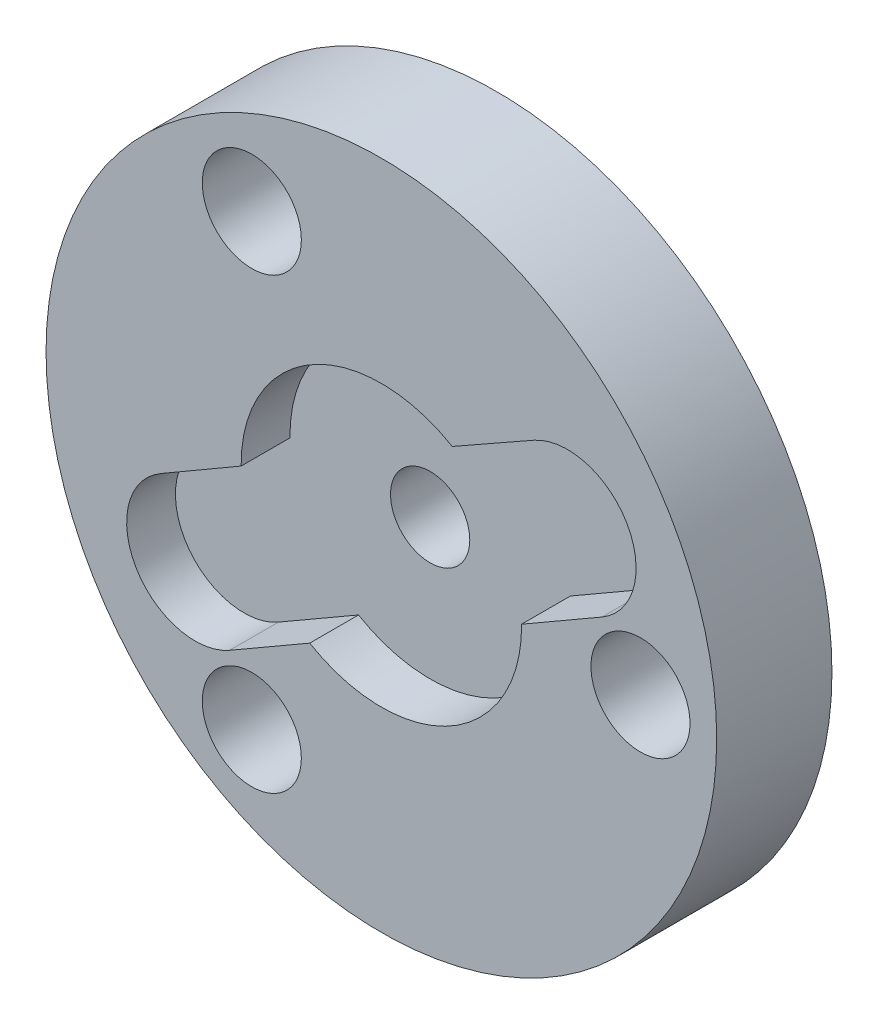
from build123d import *

# Parameters (mm, degrees)
SCHIZZO1_R                   = 11
ESTRUSIONE_ESTRUSIONE1_DEPTH = 3.781092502
SCHIZZO2_R                   = 1.625
SCHIZZO2_R_2                 = 1.3
TAGLIO_ESTRUSIONE1_DEPTH     = 17.009267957
SCHIZZO3_R                   = 1.3
TAGLIO_ESTRUSIONE2_DEPTH     = 1.6


with BuildPart() as part:
    # Schizzo1 → Estrusione-Estrusione1 (new body)
    with BuildSketch(Plane.XY):
        with Locations(Location((0, 0, 0), (0, 0, 180))):
            Circle(SCHIZZO1_R)
    extrude(amount=ESTRUSIONE_ESTRUSIONE1_DEPTH)

    # Schizzo2 → Taglio-Estrusione1 (cut, through all)
    with BuildSketch(Plane.XY.offset(3.781092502)):
        with Locations((8.5, 0)):
            Circle(SCHIZZO2_R)
        with Locations((-4.25, 7.361215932)):
            Circle(SCHIZZO2_R)
        with Locations((-4.25, -7.361215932)):
            Circle(SCHIZZO2_R)
        Circle(SCHIZZO2_R_2)
    extrude(amount=-TAGLIO_ESTRUSIONE1_DEPTH, mode=Mode.SUBTRACT)

    # Schizzo3 → Taglio-Estrusione2 (cut)
    # profile 1 of 6: a face of its own
    with BuildSketch(Plane.XY.offset(3.781092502)):
        with BuildLine():
            Line((2.324693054, 3.969357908), (-7.234922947, -1.579015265))
            ThreePointArc((-7.234922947, -1.579015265), (-8.051463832, -4.65444385), (-4.976035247, -5.470984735))
            Line((-4.976035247, -5.470984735), (7.230478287, 1.576442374))
            ThreePointArc((7.230478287, 1.576442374), (8.058653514, 4.6419645), (4.996568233, 5.482758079))
            Line((4.996568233, 5.482758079), (2.324693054, 3.969357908))
        make_face()
        Circle(SCHIZZO3_R, mode=Mode.SUBTRACT)
    # profile 2 of 6: a face of its own
    with BuildSketch(Plane.XY.offset(3.781092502)):
        with BuildLine():
            Line((-4.599733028, -0.049558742), (-1.133047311, 1.962495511))
            Line((-1.133047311, 1.962495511), (-2.3, 3.983716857))
            ThreePointArc((-2.3, 3.983716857), (-3.996048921, 2.278506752), (-4.599733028, -0.049558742))
        make_face()
    # profile 3 of 6: a face of its own
    with BuildSketch(Plane.XY.offset(3.781092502)):
        with BuildLine():
            Line((-2.3, 3.983716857), (-1.133047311, 1.962495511))
            Line((-1.133047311, 1.962495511), (2.324693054, 3.969357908))
            ThreePointArc((2.324693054, 3.969357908), (0.014282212, 4.599977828), (-2.3, 3.983716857))
        make_face()
    # profile 4 of 6: a face of its own
    with BuildSketch(Plane.XY.offset(3.781092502)):
        with BuildLine():
            Line((-4.599733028, -0.049558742), (-1.133047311, 1.962495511))
            Line((-1.133047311, 1.962495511), (-2.3, 3.983716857))
            ThreePointArc((-2.3, 3.983716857), (-3.996048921, 2.278506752), (-4.599733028, -0.049558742))
        make_face()
    # profile 5 of 6: a face of its own
    with BuildSketch(Plane.XY.offset(3.781092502)):
        with BuildLine():
            Line((-2.3, 3.983716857), (-1.133047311, 1.962495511))
            Line((-1.133047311, 1.962495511), (2.324693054, 3.969357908))
            ThreePointArc((2.324693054, 3.969357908), (0.014282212, 4.599977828), (-2.3, 3.983716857))
        make_face()
    # profile 6 of 6: a face of its own
    with BuildSketch(Plane.XY.offset(3.781092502)):
        with BuildLine():
            ThreePointArc((-2.349644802, -3.95463896), (2.299998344, -3.983717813), (4.599640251, 0.057528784))
            Line((4.599640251, 0.057528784), (-2.349644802, -3.95463896))
        make_face()
    extrude(amount=-TAGLIO_ESTRUSIONE2_DEPTH, mode=Mode.SUBTRACT)


solid = part.part
